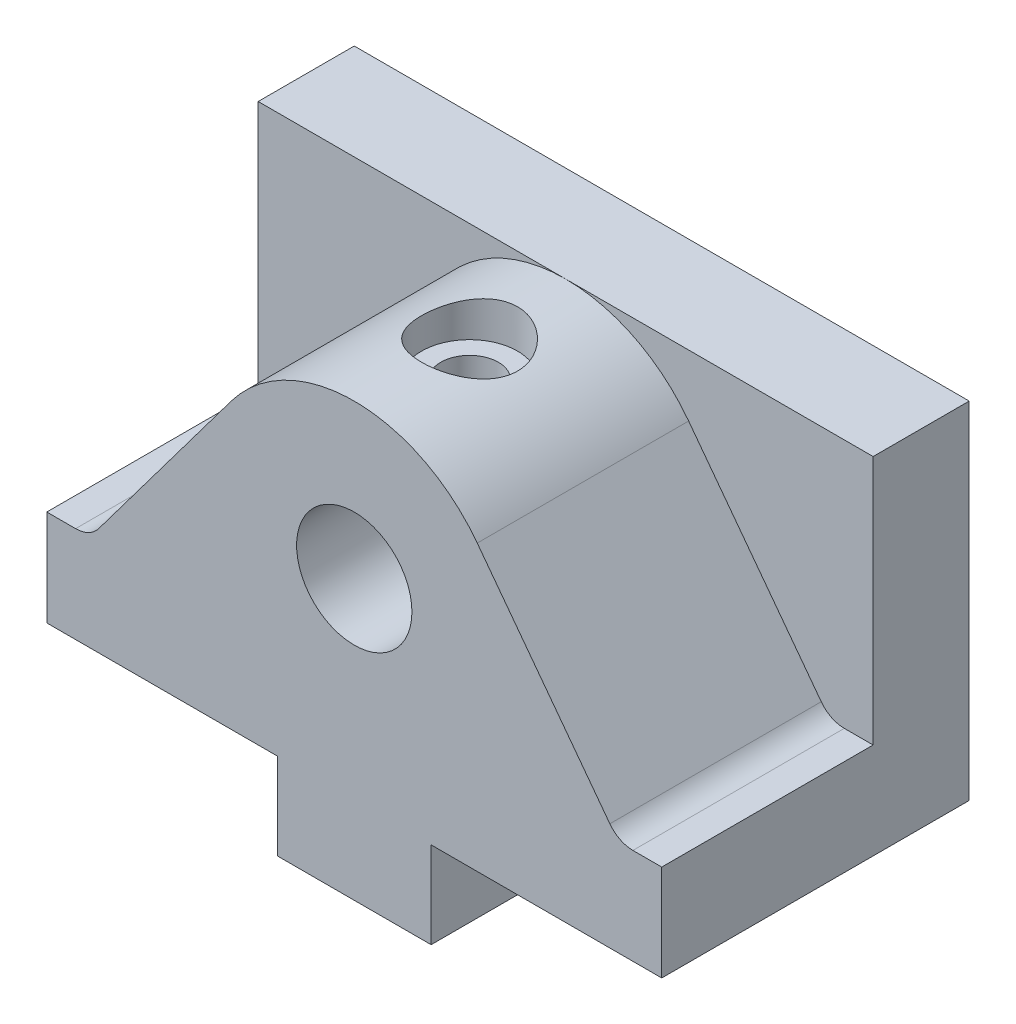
ISO-10303-21;
HEADER;
FILE_DESCRIPTION(('STEP AP214'),'2;1');
FILE_NAME('part.step','',(''),(''),'','','');
FILE_SCHEMA(('AUTOMOTIVE_DESIGN { 1 0 10303 214 1 1 1 1 }'));
ENDSEC;
DATA;
#1=APPLICATION_CONTEXT('core data for automotive mechanical design processes');
#2=APPLICATION_PROTOCOL_DEFINITION('international standard','automotive_design',2000,#1);
#3=PRODUCT_CONTEXT('',#1,'mechanical');
#4=PRODUCT('Part','Part','',(#3));
#5=PRODUCT_RELATED_PRODUCT_CATEGORY('part','',(#4));
#6=PRODUCT_DEFINITION_FORMATION('','',#4);
#7=PRODUCT_DEFINITION_CONTEXT('part definition',#1,'design');
#8=PRODUCT_DEFINITION('design','',#6,#7);
#9=PRODUCT_DEFINITION_SHAPE('','',#8);
#10=(LENGTH_UNIT() NAMED_UNIT(*) SI_UNIT(.MILLI.,.METRE.));
#11=(NAMED_UNIT(*) PLANE_ANGLE_UNIT() SI_UNIT($,.RADIAN.));
#12=(NAMED_UNIT(*) SI_UNIT($,.STERADIAN.) SOLID_ANGLE_UNIT());
#13=UNCERTAINTY_MEASURE_WITH_UNIT(LENGTH_MEASURE(1.E-05),#10,'distance_accuracy_value','');
#14=(GEOMETRIC_REPRESENTATION_CONTEXT(3) GLOBAL_UNCERTAINTY_ASSIGNED_CONTEXT((#13)) GLOBAL_UNIT_ASSIGNED_CONTEXT((#10,
#11,#12)) REPRESENTATION_CONTEXT('',''));
#15=CARTESIAN_POINT('',(0.,0.,0.));
#16=DIRECTION('',(0.,0.,1.));
#17=DIRECTION('',(1.,0.,0.));
#18=AXIS2_PLACEMENT_3D('',#15,#16,#17);
#19=CARTESIAN_POINT('',(8.,0.,22.));
#20=DIRECTION('',(0.,1.,0.));
#21=DIRECTION('',(-1.,0.,0.));
#22=AXIS2_PLACEMENT_3D('',#19,#20,#21);
#23=PLANE('',#22);
#24=DIRECTION('',(0.,0.,-1.));
#25=VECTOR('',#24,1.);
#26=CARTESIAN_POINT('',(8.,0.,22.));
#27=LINE('',#26,#25);
#28=CARTESIAN_POINT('',(8.,0.,22.));
#29=VERTEX_POINT('',#28);
#30=CARTESIAN_POINT('',(8.,0.,-10.));
#31=VERTEX_POINT('',#30);
#32=EDGE_CURVE('E276',#29,#31,#27,.T.);
#33=ORIENTED_EDGE('',*,*,#32,.T.);
#34=DIRECTION('',(-1.,0.,0.));
#35=VECTOR('',#34,1.);
#36=CARTESIAN_POINT('',(32.,0.,-10.));
#37=LINE('',#36,#35);
#38=CARTESIAN_POINT('',(32.,0.,-10.));
#39=VERTEX_POINT('',#38);
#40=EDGE_CURVE('E365',#39,#31,#37,.T.);
#41=ORIENTED_EDGE('',*,*,#40,.F.);
#42=DIRECTION('',(0.,0.,-1.));
#43=VECTOR('',#42,1.);
#44=CARTESIAN_POINT('',(32.,0.,22.));
#45=LINE('',#44,#43);
#46=CARTESIAN_POINT('',(32.,0.,22.));
#47=VERTEX_POINT('',#46);
#48=EDGE_CURVE('E264',#47,#39,#45,.T.);
#49=ORIENTED_EDGE('',*,*,#48,.F.);
#50=DIRECTION('',(1.,0.,0.));
#51=VECTOR('',#50,1.);
#52=CARTESIAN_POINT('',(8.,0.,22.));
#53=LINE('',#52,#51);
#54=EDGE_CURVE('E268',#29,#47,#53,.T.);
#55=ORIENTED_EDGE('',*,*,#54,.F.);
#56=EDGE_LOOP('',(#33,#41,#49,#55));
#57=FACE_BOUND('',#56,.T.);
#58=ADVANCED_FACE('F30',(#57),#23,.F.);
#59=CARTESIAN_POINT('',(32.,0.,22.));
#60=DIRECTION('',(-1.,0.,0.));
#61=DIRECTION('',(0.,0.,1.));
#62=AXIS2_PLACEMENT_3D('',#59,#60,#61);
#63=PLANE('',#62);
#64=ORIENTED_EDGE('',*,*,#48,.T.);
#65=DIRECTION('',(0.,-1.,0.));
#66=VECTOR('',#65,1.);
#67=CARTESIAN_POINT('',(32.,0.,-10.));
#68=LINE('',#67,#66);
#69=CARTESIAN_POINT('',(32.,36.,-10.));
#70=VERTEX_POINT('',#69);
#71=EDGE_CURVE('E340',#70,#39,#68,.T.);
#72=ORIENTED_EDGE('',*,*,#71,.F.);
#73=DIRECTION('',(0.,0.,1.));
#74=VECTOR('',#73,1.);
#75=CARTESIAN_POINT('',(32.,36.,-10.));
#76=LINE('',#75,#74);
#77=CARTESIAN_POINT('',(32.,36.,0.));
#78=VERTEX_POINT('',#77);
#79=EDGE_CURVE('E341',#70,#78,#76,.T.);
#80=ORIENTED_EDGE('',*,*,#79,.T.);
#81=DIRECTION('',(0.,-1.,0.));
#82=VECTOR('',#81,1.);
#83=CARTESIAN_POINT('',(32.,0.,0.));
#84=LINE('',#83,#82);
#85=CARTESIAN_POINT('',(32.,10.,0.));
#86=VERTEX_POINT('',#85);
#87=EDGE_CURVE('E326',#78,#86,#84,.T.);
#88=ORIENTED_EDGE('',*,*,#87,.T.);
#89=DIRECTION('',(0.,0.,-1.));
#90=VECTOR('',#89,1.);
#91=CARTESIAN_POINT('',(32.,10.,22.));
#92=LINE('',#91,#90);
#93=CARTESIAN_POINT('',(32.,10.,22.));
#94=VERTEX_POINT('',#93);
#95=EDGE_CURVE('E294',#94,#86,#92,.T.);
#96=ORIENTED_EDGE('',*,*,#95,.F.);
#97=DIRECTION('',(0.,1.,0.));
#98=VECTOR('',#97,1.);
#99=CARTESIAN_POINT('',(32.,0.,22.));
#100=LINE('',#99,#98);
#101=EDGE_CURVE('E440',#47,#94,#100,.T.);
#102=ORIENTED_EDGE('',*,*,#101,.F.);
#103=EDGE_LOOP('',(#64,#72,#80,#88,#96,#102));
#104=FACE_BOUND('',#103,.T.);
#105=ADVANCED_FACE('F220',(#104),#63,.F.);
#106=CARTESIAN_POINT('',(32.,10.,22.));
#107=DIRECTION('',(0.,-1.,0.));
#108=DIRECTION('',(1.,0.,0.));
#109=AXIS2_PLACEMENT_3D('',#106,#107,#108);
#110=PLANE('',#109);
#111=DIRECTION('',(-1.,0.,0.));
#112=VECTOR('',#111,1.);
#113=CARTESIAN_POINT('',(32.,10.,0.));
#114=LINE('',#113,#112);
#115=CARTESIAN_POINT('',(29.,10.,0.));
#116=VERTEX_POINT('',#115);
#117=EDGE_CURVE('E296',#86,#116,#114,.T.);
#118=ORIENTED_EDGE('',*,*,#117,.T.);
#119=DIRECTION('',(0.,0.,-1.));
#120=VECTOR('',#119,1.);
#121=CARTESIAN_POINT('',(29.,10.,22.));
#122=LINE('',#121,#120);
#123=CARTESIAN_POINT('',(29.,10.,22.));
#124=VERTEX_POINT('',#123);
#125=EDGE_CURVE('E49',#116,#124,#122,.F.);
#126=ORIENTED_EDGE('',*,*,#125,.T.);
#127=DIRECTION('',(-1.,0.,0.));
#128=VECTOR('',#127,1.);
#129=CARTESIAN_POINT('',(32.,10.,22.));
#130=LINE('',#129,#128);
#131=EDGE_CURVE('E434',#94,#124,#130,.T.);
#132=ORIENTED_EDGE('',*,*,#131,.F.);
#133=ORIENTED_EDGE('',*,*,#95,.T.);
#134=EDGE_LOOP('',(#118,#126,#132,#133));
#135=FACE_BOUND('',#134,.T.);
#136=ADVANCED_FACE('F226',(#135),#110,.F.);
#137=CARTESIAN_POINT('',(27.5,10.,22.));
#138=DIRECTION('',(-0.8,-0.6,0.));
#139=DIRECTION('',(0.6,-0.8,0.));
#140=AXIS2_PLACEMENT_3D('',#137,#138,#139);
#141=PLANE('',#140);
#142=DIRECTION('',(-0.6,0.8,0.));
#143=VECTOR('',#142,1.);
#144=CARTESIAN_POINT('',(27.5,10.,22.));
#145=LINE('',#144,#143);
#146=CARTESIAN_POINT('',(26.6,11.2,22.));
#147=VERTEX_POINT('',#146);
#148=CARTESIAN_POINT('',(12.8,29.6,22.));
#149=VERTEX_POINT('',#148);
#150=EDGE_CURVE('E432',#147,#149,#145,.T.);
#151=ORIENTED_EDGE('',*,*,#150,.F.);
#152=DIRECTION('',(0.,0.,-1.));
#153=VECTOR('',#152,1.);
#154=CARTESIAN_POINT('',(26.6,11.2,0.));
#155=LINE('',#154,#153);
#156=CARTESIAN_POINT('',(26.6,11.2,0.));
#157=VERTEX_POINT('',#156);
#158=EDGE_CURVE('E257',#147,#157,#155,.T.);
#159=ORIENTED_EDGE('',*,*,#158,.T.);
#160=DIRECTION('',(-0.6,0.8,0.));
#161=VECTOR('',#160,1.);
#162=CARTESIAN_POINT('',(27.5,10.,0.));
#163=LINE('',#162,#161);
#164=CARTESIAN_POINT('',(12.8,29.6,0.));
#165=VERTEX_POINT('',#164);
#166=EDGE_CURVE('E298',#157,#165,#163,.T.);
#167=ORIENTED_EDGE('',*,*,#166,.T.);
#168=DIRECTION('',(0.,0.,-1.));
#169=VECTOR('',#168,1.);
#170=CARTESIAN_POINT('',(12.8,29.6,22.));
#171=LINE('',#170,#169);
#172=EDGE_CURVE('E291',#149,#165,#171,.T.);
#173=ORIENTED_EDGE('',*,*,#172,.F.);
#174=EDGE_LOOP('',(#151,#159,#167,#173));
#175=FACE_BOUND('',#174,.T.);
#176=ADVANCED_FACE('F419',(#175),#141,.F.);
#177=CARTESIAN_POINT('',(0.,20.,22.));
#178=DIRECTION('',(0.,0.,-1.));
#179=DIRECTION('',(-1.,0.,0.));
#180=AXIS2_PLACEMENT_3D('',#177,#178,#179);
#181=CYLINDRICAL_SURFACE('',#180,16.);
#182=CARTESIAN_POINT('',(0.,36.,15.));
#183=CARTESIAN_POINT('',(-0.273756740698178,35.9999986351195,14.9999982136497));
#184=CARTESIAN_POINT('',(-0.547532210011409,35.9929077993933,14.9774430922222));
#185=CARTESIAN_POINT('',(-1.08707683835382,35.9653157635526,14.888055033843));
#186=CARTESIAN_POINT('',(-1.35284417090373,35.9448115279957,14.8212120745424));
#187=CARTESIAN_POINT('',(-1.86851417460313,35.892632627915,14.6457225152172));
#188=CARTESIAN_POINT('',(-2.11844070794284,35.860975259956,14.5371406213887));
#189=CARTESIAN_POINT('',(-2.59653920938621,35.7897587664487,14.2815307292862));
#190=CARTESIAN_POINT('',(-2.82470774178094,35.7501983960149,14.1344966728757));
#191=CARTESIAN_POINT('',(-3.25986133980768,35.6660085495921,13.8013760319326));
#192=CARTESIAN_POINT('',(-3.46608011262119,35.621268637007,13.6143164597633));
#193=CARTESIAN_POINT('',(-3.84478952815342,35.5324018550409,13.2085264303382));
#194=CARTESIAN_POINT('',(-4.01727389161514,35.4882751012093,12.9897900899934));
#195=CARTESIAN_POINT('',(-4.32777345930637,35.4044457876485,12.5202217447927));
#196=CARTESIAN_POINT('',(-4.4648313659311,35.3648795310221,12.2687300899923));
#197=CARTESIAN_POINT('',(-4.69438964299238,35.2963120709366,11.7448307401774));
#198=CARTESIAN_POINT('',(-4.78690175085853,35.2673080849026,11.4724285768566));
#199=CARTESIAN_POINT('',(-4.92193839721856,35.224304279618,10.9230876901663));
#200=CARTESIAN_POINT('',(-4.96588440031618,35.2098789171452,10.6465326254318));
#201=CARTESIAN_POINT('',(-5.00698220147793,35.1964022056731,10.0896275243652));
#202=CARTESIAN_POINT('',(-5.00414643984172,35.1973467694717,9.80927851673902));
#203=CARTESIAN_POINT('',(-4.95287298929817,35.2141275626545,9.26450215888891));
#204=CARTESIAN_POINT('',(-4.90624231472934,35.229373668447,8.99988349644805));
#205=CARTESIAN_POINT('',(-4.77163253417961,35.272081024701,8.48243137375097));
#206=CARTESIAN_POINT('',(-4.68364903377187,35.2995435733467,8.2295991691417));
#207=CARTESIAN_POINT('',(-4.46755498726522,35.3640417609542,7.73859222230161));
#208=CARTESIAN_POINT('',(-4.33887702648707,35.4012113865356,7.5006855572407));
#209=CARTESIAN_POINT('',(-4.04544082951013,35.4808742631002,7.04924892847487));
#210=CARTESIAN_POINT('',(-3.88067322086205,35.523368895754,6.83572531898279));
#211=CARTESIAN_POINT('',(-3.51086781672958,35.6112611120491,6.42890022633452));
#212=CARTESIAN_POINT('',(-3.30433828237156,35.6567027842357,6.23696176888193));
#213=CARTESIAN_POINT('',(-2.86145763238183,35.7436628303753,5.89011242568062));
#214=CARTESIAN_POINT('',(-2.625104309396,35.7851809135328,5.73520428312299));
#215=CARTESIAN_POINT('',(-2.1266584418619,35.8600517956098,5.46588924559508));
#216=CARTESIAN_POINT('',(-1.86437962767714,35.8933384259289,5.35180745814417));
#217=CARTESIAN_POINT('',(-1.32307191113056,35.9475182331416,5.16978799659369));
#218=CARTESIAN_POINT('',(-1.04404812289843,35.9684151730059,5.10183631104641));
#219=CARTESIAN_POINT('',(-0.488740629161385,35.9948555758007,5.01632782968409));
#220=CARTESIAN_POINT('',(-0.212767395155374,36.0009609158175,4.9969258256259));
#221=CARTESIAN_POINT('',(0.338521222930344,35.9987919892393,5.00386490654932));
#222=CARTESIAN_POINT('',(0.613836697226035,35.9905198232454,5.03019930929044));
#223=CARTESIAN_POINT('',(1.1488773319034,35.9608945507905,5.12638237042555));
#224=CARTESIAN_POINT('',(1.40881991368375,35.9398717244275,5.19513307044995));
#225=CARTESIAN_POINT('',(1.91340771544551,35.8872048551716,5.37285740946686));
#226=CARTESIAN_POINT('',(2.15805104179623,35.8555595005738,5.48183601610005));
#227=CARTESIAN_POINT('',(2.63172962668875,35.783941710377,5.73989286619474));
#228=CARTESIAN_POINT('',(2.86023895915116,35.7437850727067,5.88988394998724));
#229=CARTESIAN_POINT('',(3.28946340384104,35.6597364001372,6.2246128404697));
#230=CARTESIAN_POINT('',(3.4901709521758,35.6158433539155,6.40936007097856));
#231=CARTESIAN_POINT('',(3.86634985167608,35.5270797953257,6.81703556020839));
#232=CARTESIAN_POINT('',(4.04050609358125,35.4822394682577,7.04118665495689));
#233=CARTESIAN_POINT('',(4.34885000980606,35.3984778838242,7.5165064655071));
#234=CARTESIAN_POINT('',(4.48303831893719,35.3595565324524,7.76767475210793));
#235=CARTESIAN_POINT('',(4.70680333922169,35.2924712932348,8.28938069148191));
#236=CARTESIAN_POINT('',(4.7965527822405,35.264265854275,8.55983859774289));
#237=CARTESIAN_POINT('',(4.92891577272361,35.2220468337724,9.11308997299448));
#238=CARTESIAN_POINT('',(4.97154725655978,35.2080278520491,9.39587870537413));
#239=CARTESIAN_POINT('',(5.00717624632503,35.1963317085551,9.95201635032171));
#240=CARTESIAN_POINT('',(5.00233118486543,35.1979441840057,10.2252138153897));
#241=CARTESIAN_POINT('',(4.94835272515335,35.2156036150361,10.7666983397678));
#242=CARTESIAN_POINT('',(4.89922139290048,35.2316498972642,11.0349856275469));
#243=CARTESIAN_POINT('',(4.7595091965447,35.2758725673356,11.5551761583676));
#244=CARTESIAN_POINT('',(4.66954569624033,35.3038679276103,11.8072617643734));
#245=CARTESIAN_POINT('',(4.45120909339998,35.3687881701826,12.292961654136));
#246=CARTESIAN_POINT('',(4.32282817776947,35.4057148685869,12.5265721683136));
#247=CARTESIAN_POINT('',(4.02542700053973,35.4861394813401,12.9785838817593));
#248=CARTESIAN_POINT('',(3.85501334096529,35.5298379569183,13.196032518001));
#249=CARTESIAN_POINT('',(3.48083598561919,35.6179599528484,13.599945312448));
#250=CARTESIAN_POINT('',(3.27706336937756,35.6623836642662,13.7864011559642));
#251=CARTESIAN_POINT('',(2.83394665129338,35.748690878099,14.1291301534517));
#252=CARTESIAN_POINT('',(2.59365829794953,35.7904440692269,14.2842189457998));
#253=CARTESIAN_POINT('',(2.0891165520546,35.8650707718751,14.5515956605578));
#254=CARTESIAN_POINT('',(1.82487263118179,35.8979477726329,14.6639004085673));
#255=CARTESIAN_POINT('',(1.30299054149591,35.9488260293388,14.8343654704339));
#256=CARTESIAN_POINT('',(1.04668134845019,35.9678496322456,14.8962994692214));
#257=CARTESIAN_POINT('',(0.526919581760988,35.9934360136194,14.9791134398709));
#258=CARTESIAN_POINT('',(0.263468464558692,36.0000013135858,15.000001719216));
#259=CARTESIAN_POINT('',(0.,36.,15.));
#260=B_SPLINE_CURVE_WITH_KNOTS('',3,(#182,#183,#184,#185,#186,#187,#188,#189,#190,#191,#192,
#193,#194,#195,#196,#197,#198,#199,#200,#201,#202,#203,#204,#205,#206,#207,#208,#209,#210,#211,
#212,#213,#214,#215,#216,#217,#218,#219,#220,#221,#222,#223,#224,#225,#226,#227,#228,#229,#230,
#231,#232,#233,#234,#235,#236,#237,#238,#239,#240,#241,#242,#243,#244,#245,#246,#247,#248,#249,
#250,#251,#252,#253,#254,#255,#256,#257,#258,#259),.UNSPECIFIED.,.T.,.F.,(4,2,2,2,2,2,2,2,2,2,2,
2,2,2,2,2,2,2,2,2,2,2,2,2,2,2,2,2,2,2,2,2,2,2,2,2,2,2,4),(0.,0.820301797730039,1.64078929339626,
2.46000991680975,3.27935968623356,4.12151288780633,4.96382269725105,5.82695084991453,
6.68985145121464,7.52676600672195,8.36345801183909,9.16707669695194,9.97078079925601,
10.7862257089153,11.6018826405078,12.4546698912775,13.3075202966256,14.1670184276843,
15.0262553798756,15.852302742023,16.678229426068,17.4836250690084,18.2891202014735,
19.1142529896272,19.9396098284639,20.7976711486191,21.655718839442,22.5104046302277,
23.3647649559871,24.1804881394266,24.9961732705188,25.7999165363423,26.6038233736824,
27.4391805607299,28.274761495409,29.1376267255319,30.0001522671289,30.789785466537,
31.5792588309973),.UNSPECIFIED.);
#261=CARTESIAN_POINT('',(0.,36.,15.));
#262=VERTEX_POINT('',#261);
#263=EDGE_CURVE('E11',#262,#262,#260,.T.);
#264=ORIENTED_EDGE('',*,*,#263,.T.);
#265=EDGE_LOOP('',(#264));
#266=FACE_BOUND('',#265,.T.);
#267=CARTESIAN_POINT('',(0.,20.,0.));
#268=DIRECTION('',(0.,0.,1.));
#269=DIRECTION('',(1.,0.,0.));
#270=AXIS2_PLACEMENT_3D('',#267,#268,#269);
#271=CIRCLE('',#270,16.);
#272=CARTESIAN_POINT('',(0.,36.,0.));
#273=VERTEX_POINT('',#272);
#274=EDGE_CURVE('E454',#165,#273,#271,.T.);
#275=ORIENTED_EDGE('',*,*,#274,.T.);
#276=CARTESIAN_POINT('',(-12.8,29.6,0.));
#277=VERTEX_POINT('',#276);
#278=EDGE_CURVE('E453',#273,#277,#271,.T.);
#279=ORIENTED_EDGE('',*,*,#278,.T.);
#280=DIRECTION('',(0.,0.,-1.));
#281=VECTOR('',#280,1.);
#282=CARTESIAN_POINT('',(-12.8,29.6,22.));
#283=LINE('',#282,#281);
#284=CARTESIAN_POINT('',(-12.8,29.6,22.));
#285=VERTEX_POINT('',#284);
#286=EDGE_CURVE('E288',#285,#277,#283,.T.);
#287=ORIENTED_EDGE('',*,*,#286,.F.);
#288=CARTESIAN_POINT('',(0.,20.,22.));
#289=DIRECTION('',(0.,0.,1.));
#290=DIRECTION('',(1.,0.,0.));
#291=AXIS2_PLACEMENT_3D('',#288,#289,#290);
#292=CIRCLE('',#291,16.);
#293=EDGE_CURVE('E436',#149,#285,#292,.T.);
#294=ORIENTED_EDGE('',*,*,#293,.F.);
#295=ORIENTED_EDGE('',*,*,#172,.T.);
#296=EDGE_LOOP('',(#275,#279,#287,#294,#295));
#297=FACE_BOUND('',#296,.T.);
#298=ADVANCED_FACE('F414',(#266,#297),#181,.T.);
#299=CARTESIAN_POINT('',(-12.8,29.6,22.));
#300=DIRECTION('',(0.799999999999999,-0.600000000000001,0.));
#301=DIRECTION('',(0.600000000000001,0.799999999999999,0.));
#302=AXIS2_PLACEMENT_3D('',#299,#300,#301);
#303=PLANE('',#302);
#304=DIRECTION('',(-0.600000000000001,-0.799999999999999,0.));
#305=VECTOR('',#304,1.);
#306=CARTESIAN_POINT('',(-12.8,29.6,0.));
#307=LINE('',#306,#305);
#308=CARTESIAN_POINT('',(-26.6,11.2,0.));
#309=VERTEX_POINT('',#308);
#310=EDGE_CURVE('E269',#277,#309,#307,.T.);
#311=ORIENTED_EDGE('',*,*,#310,.T.);
#312=DIRECTION('',(0.,0.,-1.));
#313=VECTOR('',#312,1.);
#314=CARTESIAN_POINT('',(-26.6,11.2,22.));
#315=LINE('',#314,#313);
#316=CARTESIAN_POINT('',(-26.6,11.2,22.));
#317=VERTEX_POINT('',#316);
#318=EDGE_CURVE('E247',#309,#317,#315,.F.);
#319=ORIENTED_EDGE('',*,*,#318,.T.);
#320=DIRECTION('',(-0.600000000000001,-0.799999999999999,0.));
#321=VECTOR('',#320,1.);
#322=CARTESIAN_POINT('',(-12.8,29.6,22.));
#323=LINE('',#322,#321);
#324=EDGE_CURVE('E438',#285,#317,#323,.T.);
#325=ORIENTED_EDGE('',*,*,#324,.F.);
#326=ORIENTED_EDGE('',*,*,#286,.T.);
#327=EDGE_LOOP('',(#311,#319,#325,#326));
#328=FACE_BOUND('',#327,.T.);
#329=ADVANCED_FACE('F412',(#328),#303,.F.);
#330=CARTESIAN_POINT('',(-27.5,10.,22.));
#331=DIRECTION('',(0.,-1.,0.));
#332=DIRECTION('',(0.,0.,-1.));
#333=AXIS2_PLACEMENT_3D('',#330,#331,#332);
#334=PLANE('',#333);
#335=DIRECTION('',(-1.,0.,0.));
#336=VECTOR('',#335,1.);
#337=CARTESIAN_POINT('',(-27.5,10.,22.));
#338=LINE('',#337,#336);
#339=CARTESIAN_POINT('',(-29.,10.,22.));
#340=VERTEX_POINT('',#339);
#341=CARTESIAN_POINT('',(-32.,10.,22.));
#342=VERTEX_POINT('',#341);
#343=EDGE_CURVE('E318',#340,#342,#338,.T.);
#344=ORIENTED_EDGE('',*,*,#343,.F.);
#345=DIRECTION('',(0.,0.,-1.));
#346=VECTOR('',#345,1.);
#347=CARTESIAN_POINT('',(-29.,10.,0.));
#348=LINE('',#347,#346);
#349=CARTESIAN_POINT('',(-29.,10.,0.));
#350=VERTEX_POINT('',#349);
#351=EDGE_CURVE('E249',#340,#350,#348,.T.);
#352=ORIENTED_EDGE('',*,*,#351,.T.);
#353=DIRECTION('',(-1.,0.,0.));
#354=VECTOR('',#353,1.);
#355=CARTESIAN_POINT('',(-27.5,10.,0.));
#356=LINE('',#355,#354);
#357=CARTESIAN_POINT('',(-32.,10.,0.));
#358=VERTEX_POINT('',#357);
#359=EDGE_CURVE('E265',#350,#358,#356,.T.);
#360=ORIENTED_EDGE('',*,*,#359,.T.);
#361=DIRECTION('',(0.,0.,-1.));
#362=VECTOR('',#361,1.);
#363=CARTESIAN_POINT('',(-32.,10.,22.));
#364=LINE('',#363,#362);
#365=EDGE_CURVE('E287',#342,#358,#364,.T.);
#366=ORIENTED_EDGE('',*,*,#365,.F.);
#367=EDGE_LOOP('',(#344,#352,#360,#366));
#368=FACE_BOUND('',#367,.T.);
#369=ADVANCED_FACE('F317',(#368),#334,.F.);
#370=CARTESIAN_POINT('',(-32.,10.,22.));
#371=DIRECTION('',(1.,0.,0.));
#372=DIRECTION('',(0.,1.,0.));
#373=AXIS2_PLACEMENT_3D('',#370,#371,#372);
#374=PLANE('',#373);
#375=ORIENTED_EDGE('',*,*,#365,.T.);
#376=DIRECTION('',(0.,1.,0.));
#377=VECTOR('',#376,1.);
#378=CARTESIAN_POINT('',(-32.,0.,0.));
#379=LINE('',#378,#377);
#380=CARTESIAN_POINT('',(-32.,36.,0.));
#381=VERTEX_POINT('',#380);
#382=EDGE_CURVE('E312',#358,#381,#379,.T.);
#383=ORIENTED_EDGE('',*,*,#382,.T.);
#384=DIRECTION('',(0.,0.,1.));
#385=VECTOR('',#384,1.);
#386=CARTESIAN_POINT('',(-32.,36.,-10.));
#387=LINE('',#386,#385);
#388=CARTESIAN_POINT('',(-32.,36.,-10.));
#389=VERTEX_POINT('',#388);
#390=EDGE_CURVE('E299',#389,#381,#387,.T.);
#391=ORIENTED_EDGE('',*,*,#390,.F.);
#392=DIRECTION('',(0.,1.,0.));
#393=VECTOR('',#392,1.);
#394=CARTESIAN_POINT('',(-32.,0.,-10.));
#395=LINE('',#394,#393);
#396=CARTESIAN_POINT('',(-32.,0.,-10.));
#397=VERTEX_POINT('',#396);
#398=EDGE_CURVE('E349',#397,#389,#395,.T.);
#399=ORIENTED_EDGE('',*,*,#398,.F.);
#400=DIRECTION('',(0.,0.,-1.));
#401=VECTOR('',#400,1.);
#402=CARTESIAN_POINT('',(-32.,0.,22.));
#403=LINE('',#402,#401);
#404=CARTESIAN_POINT('',(-32.,0.,22.));
#405=VERTEX_POINT('',#404);
#406=EDGE_CURVE('E285',#405,#397,#403,.T.);
#407=ORIENTED_EDGE('',*,*,#406,.F.);
#408=DIRECTION('',(0.,-1.,0.));
#409=VECTOR('',#408,1.);
#410=CARTESIAN_POINT('',(-32.,10.,22.));
#411=LINE('',#410,#409);
#412=EDGE_CURVE('E315',#342,#405,#411,.T.);
#413=ORIENTED_EDGE('',*,*,#412,.F.);
#414=EDGE_LOOP('',(#375,#383,#391,#399,#407,#413));
#415=FACE_BOUND('',#414,.T.);
#416=ADVANCED_FACE('F309',(#415),#374,.F.);
#417=CARTESIAN_POINT('',(-32.,0.,22.));
#418=DIRECTION('',(0.,1.,0.));
#419=DIRECTION('',(-1.,0.,0.));
#420=AXIS2_PLACEMENT_3D('',#417,#418,#419);
#421=PLANE('',#420);
#422=ORIENTED_EDGE('',*,*,#406,.T.);
#423=DIRECTION('',(-1.,0.,0.));
#424=VECTOR('',#423,1.);
#425=CARTESIAN_POINT('',(-8.,0.,-10.));
#426=LINE('',#425,#424);
#427=CARTESIAN_POINT('',(-8.,0.,-10.));
#428=VERTEX_POINT('',#427);
#429=EDGE_CURVE('E352',#428,#397,#426,.T.);
#430=ORIENTED_EDGE('',*,*,#429,.F.);
#431=DIRECTION('',(0.,0.,-1.));
#432=VECTOR('',#431,1.);
#433=CARTESIAN_POINT('',(-8.,0.,22.));
#434=LINE('',#433,#432);
#435=CARTESIAN_POINT('',(-8.,0.,22.));
#436=VERTEX_POINT('',#435);
#437=EDGE_CURVE('E283',#436,#428,#434,.T.);
#438=ORIENTED_EDGE('',*,*,#437,.F.);
#439=DIRECTION('',(1.,0.,0.));
#440=VECTOR('',#439,1.);
#441=CARTESIAN_POINT('',(-32.,0.,22.));
#442=LINE('',#441,#440);
#443=EDGE_CURVE('E446',#405,#436,#442,.T.);
#444=ORIENTED_EDGE('',*,*,#443,.F.);
#445=EDGE_LOOP('',(#422,#430,#438,#444));
#446=FACE_BOUND('',#445,.T.);
#447=ADVANCED_FACE('F403',(#446),#421,.F.);
#448=CARTESIAN_POINT('',(-8.,0.,22.));
#449=DIRECTION('',(1.,0.,0.));
#450=DIRECTION('',(0.,1.,0.));
#451=AXIS2_PLACEMENT_3D('',#448,#449,#450);
#452=PLANE('',#451);
#453=ORIENTED_EDGE('',*,*,#437,.T.);
#454=DIRECTION('',(0.,1.,0.));
#455=VECTOR('',#454,1.);
#456=CARTESIAN_POINT('',(-8.,-9.00000000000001,-10.));
#457=LINE('',#456,#455);
#458=CARTESIAN_POINT('',(-8.,-9.00000000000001,-10.));
#459=VERTEX_POINT('',#458);
#460=EDGE_CURVE('E354',#459,#428,#457,.T.);
#461=ORIENTED_EDGE('',*,*,#460,.F.);
#462=DIRECTION('',(0.,0.,-1.));
#463=VECTOR('',#462,1.);
#464=CARTESIAN_POINT('',(-8.,-9.00000000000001,22.));
#465=LINE('',#464,#463);
#466=CARTESIAN_POINT('',(-8.,-9.00000000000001,22.));
#467=VERTEX_POINT('',#466);
#468=EDGE_CURVE('E281',#467,#459,#465,.T.);
#469=ORIENTED_EDGE('',*,*,#468,.F.);
#470=DIRECTION('',(0.,-1.,0.));
#471=VECTOR('',#470,1.);
#472=CARTESIAN_POINT('',(-8.,0.,22.));
#473=LINE('',#472,#471);
#474=EDGE_CURVE('E448',#436,#467,#473,.T.);
#475=ORIENTED_EDGE('',*,*,#474,.F.);
#476=EDGE_LOOP('',(#453,#461,#469,#475));
#477=FACE_BOUND('',#476,.T.);
#478=ADVANCED_FACE('F399',(#477),#452,.F.);
#479=CARTESIAN_POINT('',(-8.,-9.00000000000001,22.));
#480=DIRECTION('',(0.,1.,0.));
#481=DIRECTION('',(-1.,0.,0.));
#482=AXIS2_PLACEMENT_3D('',#479,#480,#481);
#483=PLANE('',#482);
#484=CARTESIAN_POINT('',(0.,-9.,14.));
#485=DIRECTION('',(0.,-1.,0.));
#486=DIRECTION('',(0.,0.,-1.));
#487=AXIS2_PLACEMENT_3D('',#484,#485,#486);
#488=CIRCLE('',#487,3.);
#489=CARTESIAN_POINT('',(0.,-9.,11.));
#490=VERTEX_POINT('',#489);
#491=EDGE_CURVE('E166',#490,#490,#488,.T.);
#492=ORIENTED_EDGE('',*,*,#491,.F.);
#493=EDGE_LOOP('',(#492));
#494=FACE_BOUND('',#493,.T.);
#495=CARTESIAN_POINT('',(0.,-9.,-2.));
#496=DIRECTION('',(0.,-1.,0.));
#497=DIRECTION('',(0.,0.,-1.));
#498=AXIS2_PLACEMENT_3D('',#495,#496,#497);
#499=CIRCLE('',#498,3.);
#500=CARTESIAN_POINT('',(0.,-9.,-5.));
#501=VERTEX_POINT('',#500);
#502=EDGE_CURVE('E165',#501,#501,#499,.T.);
#503=ORIENTED_EDGE('',*,*,#502,.F.);
#504=EDGE_LOOP('',(#503));
#505=FACE_BOUND('',#504,.T.);
#506=ORIENTED_EDGE('',*,*,#468,.T.);
#507=DIRECTION('',(-1.,0.,0.));
#508=VECTOR('',#507,1.);
#509=CARTESIAN_POINT('',(8.,-9.,-10.));
#510=LINE('',#509,#508);
#511=CARTESIAN_POINT('',(8.,-9.,-10.));
#512=VERTEX_POINT('',#511);
#513=EDGE_CURVE('E359',#512,#459,#510,.T.);
#514=ORIENTED_EDGE('',*,*,#513,.F.);
#515=DIRECTION('',(0.,0.,-1.));
#516=VECTOR('',#515,1.);
#517=CARTESIAN_POINT('',(8.,-9.,22.));
#518=LINE('',#517,#516);
#519=CARTESIAN_POINT('',(8.,-9.,22.));
#520=VERTEX_POINT('',#519);
#521=EDGE_CURVE('E278',#520,#512,#518,.T.);
#522=ORIENTED_EDGE('',*,*,#521,.F.);
#523=DIRECTION('',(1.,0.,0.));
#524=VECTOR('',#523,1.);
#525=CARTESIAN_POINT('',(-8.,-9.00000000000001,22.));
#526=LINE('',#525,#524);
#527=EDGE_CURVE('E450',#467,#520,#526,.T.);
#528=ORIENTED_EDGE('',*,*,#527,.F.);
#529=EDGE_LOOP('',(#506,#514,#522,#528));
#530=FACE_BOUND('',#529,.T.);
#531=ADVANCED_FACE('F395',(#494,#505,#530),#483,.F.);
#532=CARTESIAN_POINT('',(8.,-9.,22.));
#533=DIRECTION('',(-1.,0.,0.));
#534=DIRECTION('',(0.,-1.,0.));
#535=AXIS2_PLACEMENT_3D('',#532,#533,#534);
#536=PLANE('',#535);
#537=ORIENTED_EDGE('',*,*,#521,.T.);
#538=DIRECTION('',(0.,-1.,0.));
#539=VECTOR('',#538,1.);
#540=CARTESIAN_POINT('',(8.,0.,-10.));
#541=LINE('',#540,#539);
#542=EDGE_CURVE('E362',#31,#512,#541,.T.);
#543=ORIENTED_EDGE('',*,*,#542,.F.);
#544=ORIENTED_EDGE('',*,*,#32,.F.);
#545=DIRECTION('',(0.,1.,0.));
#546=VECTOR('',#545,1.);
#547=CARTESIAN_POINT('',(8.,-9.,22.));
#548=LINE('',#547,#546);
#549=EDGE_CURVE('E279',#520,#29,#548,.T.);
#550=ORIENTED_EDGE('',*,*,#549,.F.);
#551=EDGE_LOOP('',(#537,#543,#544,#550));
#552=FACE_BOUND('',#551,.T.);
#553=ADVANCED_FACE('F391',(#552),#536,.F.);
#554=CARTESIAN_POINT('',(0.,20.,22.));
#555=DIRECTION('',(0.,0.,1.));
#556=DIRECTION('',(1.,0.,0.));
#557=AXIS2_PLACEMENT_3D('',#554,#555,#556);
#558=PLANE('',#557);
#559=CARTESIAN_POINT('',(0.,20.,22.));
#560=DIRECTION('',(0.,0.,1.));
#561=DIRECTION('',(1.,0.,0.));
#562=AXIS2_PLACEMENT_3D('',#559,#560,#561);
#563=CIRCLE('',#562,6.);
#564=CARTESIAN_POINT('',(6.,20.,22.));
#565=VERTEX_POINT('',#564);
#566=EDGE_CURVE('E189',#565,#565,#563,.T.);
#567=ORIENTED_EDGE('',*,*,#566,.F.);
#568=EDGE_LOOP('',(#567));
#569=FACE_BOUND('',#568,.T.);
#570=ORIENTED_EDGE('',*,*,#54,.T.);
#571=ORIENTED_EDGE('',*,*,#101,.T.);
#572=ORIENTED_EDGE('',*,*,#131,.T.);
#573=CARTESIAN_POINT('',(29.,13.,22.));
#574=DIRECTION('',(0.,0.,1.));
#575=DIRECTION('',(1.,0.,0.));
#576=AXIS2_PLACEMENT_3D('',#573,#574,#575);
#577=CIRCLE('',#576,3.);
#578=EDGE_CURVE('E42',#124,#147,#577,.F.);
#579=ORIENTED_EDGE('',*,*,#578,.T.);
#580=ORIENTED_EDGE('',*,*,#150,.T.);
#581=ORIENTED_EDGE('',*,*,#293,.T.);
#582=ORIENTED_EDGE('',*,*,#324,.T.);
#583=CARTESIAN_POINT('',(-29.,13.,22.));
#584=DIRECTION('',(0.,0.,1.));
#585=DIRECTION('',(1.,0.,0.));
#586=AXIS2_PLACEMENT_3D('',#583,#584,#585);
#587=CIRCLE('',#586,3.);
#588=EDGE_CURVE('E246',#317,#340,#587,.F.);
#589=ORIENTED_EDGE('',*,*,#588,.T.);
#590=ORIENTED_EDGE('',*,*,#343,.T.);
#591=ORIENTED_EDGE('',*,*,#412,.T.);
#592=ORIENTED_EDGE('',*,*,#443,.T.);
#593=ORIENTED_EDGE('',*,*,#474,.T.);
#594=ORIENTED_EDGE('',*,*,#527,.T.);
#595=ORIENTED_EDGE('',*,*,#549,.T.);
#596=EDGE_LOOP('',(#570,#571,#572,#579,#580,#581,#582,#589,#590,#591,#592,#593,#594,#595));
#597=FACE_BOUND('',#596,.T.);
#598=ADVANCED_FACE('F386',(#569,#597),#558,.T.);
#599=CARTESIAN_POINT('',(32.,36.,0.));
#600=DIRECTION('',(0.,0.,1.));
#601=DIRECTION('',(1.,0.,0.));
#602=AXIS2_PLACEMENT_3D('',#599,#600,#601);
#603=PLANE('',#602);
#604=ORIENTED_EDGE('',*,*,#359,.F.);
#605=CARTESIAN_POINT('',(-29.,13.,0.));
#606=DIRECTION('',(0.,0.,1.));
#607=DIRECTION('',(1.,0.,0.));
#608=AXIS2_PLACEMENT_3D('',#605,#606,#607);
#609=CIRCLE('',#608,3.);
#610=EDGE_CURVE('E261',#350,#309,#609,.T.);
#611=ORIENTED_EDGE('',*,*,#610,.T.);
#612=ORIENTED_EDGE('',*,*,#310,.F.);
#613=ORIENTED_EDGE('',*,*,#278,.F.);
#614=DIRECTION('',(1.,0.,0.));
#615=VECTOR('',#614,1.);
#616=CARTESIAN_POINT('',(32.,36.,0.));
#617=LINE('',#616,#615);
#618=EDGE_CURVE('E324',#381,#273,#617,.T.);
#619=ORIENTED_EDGE('',*,*,#618,.F.);
#620=ORIENTED_EDGE('',*,*,#382,.F.);
#621=EDGE_LOOP('',(#604,#611,#612,#613,#619,#620));
#622=FACE_BOUND('',#621,.T.);
#623=ADVANCED_FACE('F322',(#622),#603,.T.);
#624=ORIENTED_EDGE('',*,*,#166,.F.);
#625=CARTESIAN_POINT('',(29.,13.,0.));
#626=DIRECTION('',(0.,0.,1.));
#627=DIRECTION('',(1.,0.,0.));
#628=AXIS2_PLACEMENT_3D('',#625,#626,#627);
#629=CIRCLE('',#628,3.);
#630=EDGE_CURVE('E57',#157,#116,#629,.T.);
#631=ORIENTED_EDGE('',*,*,#630,.T.);
#632=ORIENTED_EDGE('',*,*,#117,.F.);
#633=ORIENTED_EDGE('',*,*,#87,.F.);
#634=EDGE_CURVE('E325',#273,#78,#617,.T.);
#635=ORIENTED_EDGE('',*,*,#634,.F.);
#636=ORIENTED_EDGE('',*,*,#274,.F.);
#637=EDGE_LOOP('',(#624,#631,#632,#633,#635,#636));
#638=FACE_BOUND('',#637,.T.);
#639=ADVANCED_FACE('F385',(#638),#603,.T.);
#640=CARTESIAN_POINT('',(32.,36.,-10.));
#641=DIRECTION('',(0.,-1.,0.));
#642=DIRECTION('',(0.,0.,-1.));
#643=AXIS2_PLACEMENT_3D('',#640,#641,#642);
#644=PLANE('',#643);
#645=ORIENTED_EDGE('',*,*,#618,.T.);
#646=ORIENTED_EDGE('',*,*,#634,.T.);
#647=ORIENTED_EDGE('',*,*,#79,.F.);
#648=DIRECTION('',(1.,0.,0.));
#649=VECTOR('',#648,1.);
#650=CARTESIAN_POINT('',(32.,36.,-10.));
#651=LINE('',#650,#649);
#652=EDGE_CURVE('E343',#389,#70,#651,.T.);
#653=ORIENTED_EDGE('',*,*,#652,.F.);
#654=ORIENTED_EDGE('',*,*,#390,.T.);
#655=EDGE_LOOP('',(#645,#646,#647,#653,#654));
#656=FACE_BOUND('',#655,.T.);
#657=ADVANCED_FACE('F240',(#656),#644,.F.);
#658=CARTESIAN_POINT('',(32.,36.,-10.));
#659=DIRECTION('',(0.,0.,1.));
#660=DIRECTION('',(1.,0.,0.));
#661=AXIS2_PLACEMENT_3D('',#658,#659,#660);
#662=PLANE('',#661);
#663=ORIENTED_EDGE('',*,*,#71,.T.);
#664=ORIENTED_EDGE('',*,*,#40,.T.);
#665=ORIENTED_EDGE('',*,*,#542,.T.);
#666=ORIENTED_EDGE('',*,*,#513,.T.);
#667=ORIENTED_EDGE('',*,*,#460,.T.);
#668=ORIENTED_EDGE('',*,*,#429,.T.);
#669=ORIENTED_EDGE('',*,*,#398,.T.);
#670=ORIENTED_EDGE('',*,*,#652,.T.);
#671=EDGE_LOOP('',(#663,#664,#665,#666,#667,#668,#669,#670));
#672=FACE_BOUND('',#671,.T.);
#673=ADVANCED_FACE('F232',(#672),#662,.F.);
#674=CARTESIAN_POINT('',(-29.,13.,22.));
#675=DIRECTION('',(0.,0.,1.));
#676=DIRECTION('',(1.,0.,0.));
#677=AXIS2_PLACEMENT_3D('',#674,#675,#676);
#678=CYLINDRICAL_SURFACE('',#677,3.);
#679=ORIENTED_EDGE('',*,*,#588,.F.);
#680=ORIENTED_EDGE('',*,*,#318,.F.);
#681=ORIENTED_EDGE('',*,*,#610,.F.);
#682=ORIENTED_EDGE('',*,*,#351,.F.);
#683=EDGE_LOOP('',(#679,#680,#681,#682));
#684=FACE_BOUND('',#683,.T.);
#685=ADVANCED_FACE('F230',(#684),#678,.F.);
#686=CARTESIAN_POINT('',(29.,13.,22.));
#687=DIRECTION('',(0.,0.,1.));
#688=DIRECTION('',(1.,0.,0.));
#689=AXIS2_PLACEMENT_3D('',#686,#687,#688);
#690=CYLINDRICAL_SURFACE('',#689,3.);
#691=ORIENTED_EDGE('',*,*,#578,.F.);
#692=ORIENTED_EDGE('',*,*,#125,.F.);
#693=ORIENTED_EDGE('',*,*,#630,.F.);
#694=ORIENTED_EDGE('',*,*,#158,.F.);
#695=EDGE_LOOP('',(#691,#692,#693,#694));
#696=FACE_BOUND('',#695,.T.);
#697=ADVANCED_FACE('F32',(#696),#690,.F.);
#698=CARTESIAN_POINT('',(0.,20.,-2.));
#699=DIRECTION('',(0.,0.,1.));
#700=DIRECTION('',(1.,0.,0.));
#701=AXIS2_PLACEMENT_3D('',#698,#699,#700);
#702=CYLINDRICAL_SURFACE('',#701,6.);
#703=CARTESIAN_POINT('',(0.,26.,13.));
#704=CARTESIAN_POINT('',(0.0788941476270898,25.9999993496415,12.9999991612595));
#705=CARTESIAN_POINT('',(0.15779662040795,25.9984386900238,12.9968820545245));
#706=CARTESIAN_POINT('',(0.315001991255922,25.9922435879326,12.98446072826));
#707=CARTESIAN_POINT('',(0.393304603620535,25.987607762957,12.9751537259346));
#708=CARTESIAN_POINT('',(0.626628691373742,25.9692197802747,12.9380421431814));
#709=CARTESIAN_POINT('',(0.779952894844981,25.950987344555,12.9010471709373));
#710=CARTESIAN_POINT('',(1.07683586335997,25.9044896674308,12.8044182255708));
#711=CARTESIAN_POINT('',(1.22043005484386,25.8762634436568,12.7448722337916));
#712=CARTESIAN_POINT('',(1.49540820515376,25.8123730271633,12.6052887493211));
#713=CARTESIAN_POINT('',(1.62679312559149,25.7767094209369,12.5252528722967));
#714=CARTESIAN_POINT('',(1.88252701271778,25.6986875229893,12.3414460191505));
#715=CARTESIAN_POINT('',(2.0059694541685,25.6560547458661,12.2365320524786));
#716=CARTESIAN_POINT('',(2.23433451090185,25.5698003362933,12.0084440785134));
#717=CARTESIAN_POINT('',(2.33924301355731,25.5261779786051,11.8852562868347));
#718=CARTESIAN_POINT('',(2.53576864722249,25.4389634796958,11.6125156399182));
#719=CARTESIAN_POINT('',(2.62572411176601,25.3956360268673,11.4616590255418));
#720=CARTESIAN_POINT('',(2.7403403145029,25.3378244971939,11.2240491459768));
#721=CARTESIAN_POINT('',(2.77516786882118,25.3197457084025,11.1429290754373));
#722=CARTESIAN_POINT('',(2.83769299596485,25.2866576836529,10.9773994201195));
#723=CARTESIAN_POINT('',(2.86539478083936,25.2716466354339,10.8929918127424));
#724=CARTESIAN_POINT('',(2.91188280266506,25.2461034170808,10.7266042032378));
#725=CARTESIAN_POINT('',(2.93110042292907,25.235358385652,10.6447772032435));
#726=CARTESIAN_POINT('',(2.9626355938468,25.2175778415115,10.4794450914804));
#727=CARTESIAN_POINT('',(2.97495680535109,25.2105403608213,10.3959408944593));
#728=CARTESIAN_POINT('',(2.99251382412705,25.2004775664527,10.2279936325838));
#729=CARTESIAN_POINT('',(2.99775389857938,25.1974498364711,10.1435511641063));
#730=CARTESIAN_POINT('',(3.00108452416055,25.1955255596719,9.97450634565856));
#731=CARTESIAN_POINT('',(2.9991757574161,25.1966286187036,9.88990401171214));
#732=CARTESIAN_POINT('',(2.98404973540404,25.2053466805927,9.65724610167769));
#733=CARTESIAN_POINT('',(2.96335042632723,25.2172679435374,9.50975584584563));
#734=CARTESIAN_POINT('',(2.90082280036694,25.2522818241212,9.22080632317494));
#735=CARTESIAN_POINT('',(2.85898775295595,25.2753780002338,9.07934899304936));
#736=CARTESIAN_POINT('',(2.75462843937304,25.3306256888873,8.80232034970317));
#737=CARTESIAN_POINT('',(2.69164495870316,25.36297559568,8.66696288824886));
#738=CARTESIAN_POINT('',(2.54712530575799,25.4331017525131,8.40809503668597));
#739=CARTESIAN_POINT('',(2.46558080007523,25.4708804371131,8.28459000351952));
#740=CARTESIAN_POINT('',(2.27419808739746,25.5533948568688,8.03643690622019));
#741=CARTESIAN_POINT('',(2.16208335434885,25.5984053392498,7.9136295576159));
#742=CARTESIAN_POINT('',(1.91866675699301,25.6864286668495,7.68779356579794));
#743=CARTESIAN_POINT('',(1.78735577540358,25.7294405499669,7.58477437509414));
#744=CARTESIAN_POINT('',(1.50154951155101,25.8110596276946,7.39694306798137));
#745=CARTESIAN_POINT('',(1.3462607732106,25.8493695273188,7.31319859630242));
#746=CARTESIAN_POINT('',(1.02139864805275,25.9147364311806,7.17370889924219));
#747=CARTESIAN_POINT('',(0.85183672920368,25.9418023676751,7.11794144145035));
#748=CARTESIAN_POINT('',(0.51829947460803,25.9797300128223,7.04057379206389));
#749=CARTESIAN_POINT('',(0.355024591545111,25.9917481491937,7.01652629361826));
#750=CARTESIAN_POINT('',(0.0263387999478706,26.0021904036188,6.99560580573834));
#751=CARTESIAN_POINT('',(-0.139071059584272,26.0006209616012,6.99871994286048));
#752=CARTESIAN_POINT('',(-0.453698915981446,25.9847357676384,7.03062006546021));
#753=CARTESIAN_POINT('',(-0.603178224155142,25.9714173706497,7.05739759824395));
#754=CARTESIAN_POINT('',(-0.895220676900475,25.9346651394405,7.1327142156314));
#755=CARTESIAN_POINT('',(-1.03778305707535,25.911230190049,7.18125569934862));
#756=CARTESIAN_POINT('',(-1.31666582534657,25.8555275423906,7.29999539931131));
#757=CARTESIAN_POINT('',(-1.45269119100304,25.8230264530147,7.37077315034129));
#758=CARTESIAN_POINT('',(-1.71138408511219,25.7523192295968,7.53132260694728));
#759=CARTESIAN_POINT('',(-1.83404588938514,25.7141106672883,7.62110240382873));
#760=CARTESIAN_POINT('',(-2.07530306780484,25.6312466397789,7.82728127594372));
#761=CARTESIAN_POINT('',(-2.19231623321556,25.5863265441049,7.94542860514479));
#762=CARTESIAN_POINT('',(-2.40556896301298,25.497871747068,8.1997754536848));
#763=CARTESIAN_POINT('',(-2.50179415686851,25.4543380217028,8.33598735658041));
#764=CARTESIAN_POINT('',(-2.675123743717,25.3715357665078,8.63093096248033));
#765=CARTESIAN_POINT('',(-2.75107648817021,25.3325758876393,8.79043379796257));
#766=CARTESIAN_POINT('',(-2.87424847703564,25.2672221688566,9.12253020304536));
#767=CARTESIAN_POINT('',(-2.92150474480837,25.2408121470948,9.2951065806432));
#768=CARTESIAN_POINT('',(-2.98158506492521,25.2068450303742,9.63073066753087));
#769=CARTESIAN_POINT('',(-2.997278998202,25.1977215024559,9.79310275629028));
#770=CARTESIAN_POINT('',(-3.00206745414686,25.1949606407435,10.1183412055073));
#771=CARTESIAN_POINT('',(-2.99117350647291,25.2013165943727,10.2812073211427));
#772=CARTESIAN_POINT('',(-2.94577840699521,25.227135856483,10.5864504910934));
#773=CARTESIAN_POINT('',(-2.91362505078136,25.2452928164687,10.7293013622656));
#774=CARTESIAN_POINT('',(-2.82952596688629,25.2911305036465,11.0074244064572));
#775=CARTESIAN_POINT('',(-2.77757387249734,25.3188142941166,11.142694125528));
#776=CARTESIAN_POINT('',(-2.65144766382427,25.3828558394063,11.4118743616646));
#777=CARTESIAN_POINT('',(-2.57601505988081,25.4196713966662,11.5450829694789));
#778=CARTESIAN_POINT('',(-2.40645126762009,25.4970602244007,11.7978243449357));
#779=CARTESIAN_POINT('',(-2.31231035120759,25.5376354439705,11.9173499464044));
#780=CARTESIAN_POINT('',(-2.094616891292,25.6238685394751,12.1544228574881));
#781=CARTESIAN_POINT('',(-1.96888052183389,25.6695449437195,12.2699651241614));
#782=CARTESIAN_POINT('',(-1.69843715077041,25.7563371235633,12.478801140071));
#783=CARTESIAN_POINT('',(-1.55371998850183,25.7974504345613,12.5720828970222));
#784=CARTESIAN_POINT('',(-1.32452333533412,25.8525140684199,12.6931781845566));
#785=CARTESIAN_POINT('',(-1.24575314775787,25.8698252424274,12.7305202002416));
#786=CARTESIAN_POINT('',(-1.08479725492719,25.9016884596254,12.7983616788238));
#787=CARTESIAN_POINT('',(-1.00261324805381,25.9162418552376,12.8288644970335));
#788=CARTESIAN_POINT('',(-0.835616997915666,25.9421269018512,12.8826072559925));
#789=CARTESIAN_POINT('',(-0.750810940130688,25.9534655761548,12.905863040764));
#790=CARTESIAN_POINT('',(-0.579142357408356,25.9726077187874,12.9448825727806));
#791=CARTESIAN_POINT('',(-0.492281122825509,25.9804133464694,12.9606508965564));
#792=CARTESIAN_POINT('',(-0.337824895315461,25.9908582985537,12.9816846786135));
#793=CARTESIAN_POINT('',(-0.270495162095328,25.9942803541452,12.988546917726));
#794=CARTESIAN_POINT('',(-0.135445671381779,25.9988515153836,12.9977050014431));
#795=CARTESIAN_POINT('',(-0.0677259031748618,26.0000005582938,13.0000007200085));
#796=CARTESIAN_POINT('',(0.,26.,13.));
#797=B_SPLINE_CURVE_WITH_KNOTS('',3,(#703,#704,#705,#706,#707,#708,#709,#710,#711,#712,#713,
#714,#715,#716,#717,#718,#719,#720,#721,#722,#723,#724,#725,#726,#727,#728,#729,#730,#731,#732,
#733,#734,#735,#736,#737,#738,#739,#740,#741,#742,#743,#744,#745,#746,#747,#748,#749,#750,#751,
#752,#753,#754,#755,#756,#757,#758,#759,#760,#761,#762,#763,#764,#765,#766,#767,#768,#769,#770,
#771,#772,#773,#774,#775,#776,#777,#778,#779,#780,#781,#782,#783,#784,#785,#786,#787,#788,#789,
#790,#791,#792,#793,#794,#795,#796),.UNSPECIFIED.,.T.,.F.,(4,2,2,2,2,2,2,2,2,2,2,2,2,2,2,2,2,2,
2,2,2,2,2,2,2,2,2,2,2,2,2,2,2,2,2,2,2,2,2,2,2,2,2,2,2,2,4),(0.,0.236611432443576,
0.4733293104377,0.947100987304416,1.41904300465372,1.89094781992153,2.39140181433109,
2.89223525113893,3.4319083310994,3.70192714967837,3.97178599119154,4.2256372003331,
4.47935352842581,4.73291689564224,4.98645606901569,5.43238672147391,5.87845946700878,
6.33492255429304,6.79159098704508,7.30616358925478,7.82098138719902,8.35970601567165,
8.89800185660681,9.3917140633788,9.88519228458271,10.3404225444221,10.7957029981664,
11.2640010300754,11.7324988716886,12.2470036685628,12.7618630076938,13.3016558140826,
13.8407507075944,14.3280945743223,14.8152271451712,15.2559532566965,15.6968212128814,
16.1673090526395,16.6380421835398,17.1659726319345,17.6941868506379,17.9605054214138,
18.2266930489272,18.4922945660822,18.7577335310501,18.9608446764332,19.1639614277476),.UNSPECIFIED.);
#798=CARTESIAN_POINT('',(0.,26.,13.));
#799=VERTEX_POINT('',#798);
#800=EDGE_CURVE('E182',#799,#799,#797,.T.);
#801=ORIENTED_EDGE('',*,*,#800,.T.);
#802=EDGE_LOOP('',(#801));
#803=FACE_BOUND('',#802,.T.);
#804=CARTESIAN_POINT('',(0.,20.,-2.));
#805=DIRECTION('',(0.,0.,1.));
#806=DIRECTION('',(1.,0.,0.));
#807=AXIS2_PLACEMENT_3D('',#804,#805,#806);
#808=CIRCLE('',#807,6.);
#809=CARTESIAN_POINT('',(6.,20.,-2.));
#810=VERTEX_POINT('',#809);
#811=EDGE_CURVE('E190',#810,#810,#808,.T.);
#812=ORIENTED_EDGE('',*,*,#811,.F.);
#813=EDGE_LOOP('',(#812));
#814=FACE_BOUND('',#813,.T.);
#815=ORIENTED_EDGE('',*,*,#566,.T.);
#816=EDGE_LOOP('',(#815));
#817=FACE_BOUND('',#816,.T.);
#818=ADVANCED_FACE('F238',(#803,#814,#817),#702,.F.);
#819=CARTESIAN_POINT('',(0.,20.,-2.));
#820=DIRECTION('',(0.,0.,1.));
#821=DIRECTION('',(1.,0.,0.));
#822=AXIS2_PLACEMENT_3D('',#819,#820,#821);
#823=PLANE('',#822);
#824=ORIENTED_EDGE('',*,*,#811,.T.);
#825=EDGE_LOOP('',(#824));
#826=FACE_BOUND('',#825,.T.);
#827=ADVANCED_FACE('F207',(#826),#823,.T.);
#828=CARTESIAN_POINT('',(0.,36.,10.));
#829=DIRECTION('',(0.,1.,0.));
#830=DIRECTION('',(0.,0.,1.));
#831=AXIS2_PLACEMENT_3D('',#828,#829,#830);
#832=CYLINDRICAL_SURFACE('',#831,5.);
#833=CARTESIAN_POINT('',(0.,32.,10.));
#834=DIRECTION('',(0.,1.,0.));
#835=DIRECTION('',(0.,0.,1.));
#836=AXIS2_PLACEMENT_3D('',#833,#834,#835);
#837=CIRCLE('',#836,5.);
#838=CARTESIAN_POINT('',(0.,32.,15.));
#839=VERTEX_POINT('',#838);
#840=EDGE_CURVE('E176',#839,#839,#837,.T.);
#841=ORIENTED_EDGE('',*,*,#840,.F.);
#842=EDGE_LOOP('',(#841));
#843=FACE_BOUND('',#842,.T.);
#844=ORIENTED_EDGE('',*,*,#263,.F.);
#845=EDGE_LOOP('',(#844));
#846=FACE_BOUND('',#845,.T.);
#847=ADVANCED_FACE('F199',(#843,#846),#832,.F.);
#848=CARTESIAN_POINT('',(0.,36.,10.));
#849=DIRECTION('',(0.,1.,0.));
#850=DIRECTION('',(0.,0.,1.));
#851=AXIS2_PLACEMENT_3D('',#848,#849,#850);
#852=CYLINDRICAL_SURFACE('',#851,3.);
#853=ORIENTED_EDGE('',*,*,#800,.F.);
#854=EDGE_LOOP('',(#853));
#855=FACE_BOUND('',#854,.T.);
#856=CARTESIAN_POINT('',(0.,32.,10.));
#857=DIRECTION('',(0.,1.,0.));
#858=DIRECTION('',(0.,0.,1.));
#859=AXIS2_PLACEMENT_3D('',#856,#857,#858);
#860=CIRCLE('',#859,3.);
#861=CARTESIAN_POINT('',(0.,32.,13.));
#862=VERTEX_POINT('',#861);
#863=EDGE_CURVE('E179',#862,#862,#860,.T.);
#864=ORIENTED_EDGE('',*,*,#863,.T.);
#865=EDGE_LOOP('',(#864));
#866=FACE_BOUND('',#865,.T.);
#867=ADVANCED_FACE('F194',(#855,#866),#852,.F.);
#868=CARTESIAN_POINT('',(3.,32.,10.));
#869=DIRECTION('',(0.,-1.,0.));
#870=DIRECTION('',(0.,0.,-1.));
#871=AXIS2_PLACEMENT_3D('',#868,#869,#870);
#872=PLANE('',#871);
#873=ORIENTED_EDGE('',*,*,#863,.F.);
#874=EDGE_LOOP('',(#873));
#875=FACE_BOUND('',#874,.T.);
#876=ORIENTED_EDGE('',*,*,#840,.T.);
#877=EDGE_LOOP('',(#876));
#878=FACE_BOUND('',#877,.T.);
#879=ADVANCED_FACE('F198',(#875,#878),#872,.F.);
#880=CARTESIAN_POINT('',(0.,7.,-2.));
#881=DIRECTION('',(0.,-1.,0.));
#882=DIRECTION('',(0.,0.,-1.));
#883=AXIS2_PLACEMENT_3D('',#880,#881,#882);
#884=CONICAL_SURFACE('',#883,3.,1.02974425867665);
#885=CARTESIAN_POINT('',(0.,8.80258185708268,-2.));
#886=VERTEX_POINT('',#885);
#887=VERTEX_LOOP('',#886);
#888=FACE_BOUND('',#887,.T.);
#889=CARTESIAN_POINT('',(0.,7.,-2.));
#890=DIRECTION('',(0.,-1.,0.));
#891=DIRECTION('',(0.,0.,-1.));
#892=AXIS2_PLACEMENT_3D('',#889,#890,#891);
#893=CIRCLE('',#892,3.);
#894=CARTESIAN_POINT('',(0.,7.,-5.));
#895=VERTEX_POINT('',#894);
#896=EDGE_CURVE('E169',#895,#895,#893,.T.);
#897=ORIENTED_EDGE('',*,*,#896,.T.);
#898=EDGE_LOOP('',(#897));
#899=FACE_BOUND('',#898,.T.);
#900=ADVANCED_FACE('F202',(#888,#899),#884,.F.);
#901=CARTESIAN_POINT('',(0.,-9.,-2.));
#902=DIRECTION('',(0.,-1.,0.));
#903=DIRECTION('',(0.,0.,-1.));
#904=AXIS2_PLACEMENT_3D('',#901,#902,#903);
#905=CYLINDRICAL_SURFACE('',#904,3.);
#906=ORIENTED_EDGE('',*,*,#896,.F.);
#907=EDGE_LOOP('',(#906));
#908=FACE_BOUND('',#907,.T.);
#909=ORIENTED_EDGE('',*,*,#502,.T.);
#910=EDGE_LOOP('',(#909));
#911=FACE_BOUND('',#910,.T.);
#912=ADVANCED_FACE('F159',(#908,#911),#905,.F.);
#913=CARTESIAN_POINT('',(0.,7.,14.));
#914=DIRECTION('',(0.,-1.,0.));
#915=DIRECTION('',(0.,0.,-1.));
#916=AXIS2_PLACEMENT_3D('',#913,#914,#915);
#917=CONICAL_SURFACE('',#916,3.,1.02974425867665);
#918=CARTESIAN_POINT('',(0.,8.80258185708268,14.));
#919=VERTEX_POINT('',#918);
#920=VERTEX_LOOP('',#919);
#921=FACE_BOUND('',#920,.T.);
#922=CARTESIAN_POINT('',(0.,7.,14.));
#923=DIRECTION('',(0.,-1.,0.));
#924=DIRECTION('',(0.,0.,-1.));
#925=AXIS2_PLACEMENT_3D('',#922,#923,#924);
#926=CIRCLE('',#925,3.);
#927=CARTESIAN_POINT('',(0.,7.,11.));
#928=VERTEX_POINT('',#927);
#929=EDGE_CURVE('E163',#928,#928,#926,.T.);
#930=ORIENTED_EDGE('',*,*,#929,.T.);
#931=EDGE_LOOP('',(#930));
#932=FACE_BOUND('',#931,.T.);
#933=ADVANCED_FACE('F155',(#921,#932),#917,.F.);
#934=CARTESIAN_POINT('',(0.,-9.,14.));
#935=DIRECTION('',(0.,-1.,0.));
#936=DIRECTION('',(0.,0.,-1.));
#937=AXIS2_PLACEMENT_3D('',#934,#935,#936);
#938=CYLINDRICAL_SURFACE('',#937,3.);
#939=ORIENTED_EDGE('',*,*,#929,.F.);
#940=EDGE_LOOP('',(#939));
#941=FACE_BOUND('',#940,.T.);
#942=ORIENTED_EDGE('',*,*,#491,.T.);
#943=EDGE_LOOP('',(#942));
#944=FACE_BOUND('',#943,.T.);
#945=ADVANCED_FACE('F158',(#941,#944),#938,.F.);
#946=CLOSED_SHELL('',(#58,#105,#136,#176,#298,#329,#369,#416,#447,#478,#531,#553,#598,#623,#639,
#657,#673,#685,#697,#818,#827,#847,#867,#879,#900,#912,#933,#945));
#947=MANIFOLD_SOLID_BREP('B2',#946);
#948=ADVANCED_BREP_SHAPE_REPRESENTATION('',(#18,#947),#14);
#949=SHAPE_DEFINITION_REPRESENTATION(#9,#948);
ENDSEC;
END-ISO-10303-21;
